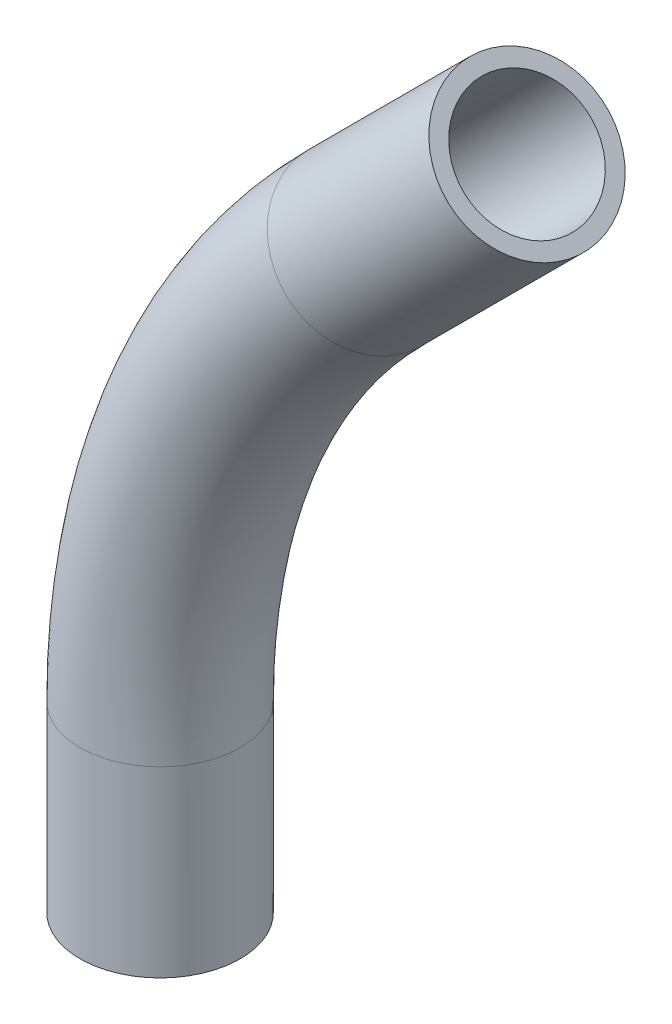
from build123d import *

# Parameters (mm, degrees)
ROUTE_R                       = 16.7005
ELBOWSHELL_T                  = -3.3782
SKETCH2_R                     = 16.7005
SKETCH2_R_2                   = 13.3223
ELBOWEXTENSION_EXTRUDE1_DEPTH = 47.625
SKETCH3_R                     = 16.7005
SKETCH3_R_2                   = 13.3223
ELBOWEXTENSION_EXTRUDE2_DEPTH = 38.1


with BuildPart() as part:
    # Elbow: sweep along a path in ElbowArc
    with BuildLine(Plane.XY) as elbow_path:
        ThreePointArc((-146.05, 0), (-134.932605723, 55.890915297), (-103.272945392, 103.272945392))
    # Route → Elbow (sweep)
    with BuildSketch(Plane(origin=(0, 0, 0), x_dir=(1, 0, 0), z_dir=(0, 1, 0))):
        with Locations((-146.05, 0)):
            Circle(ROUTE_R)
    sweep(path=elbow_path.line)

    # ElbowShell
    elbowshell_openings = [part.faces().sort_by_distance(p)[0] for p in [
        (-103.272945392, 103.272945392, 0),
        (-146.05, 0, 0),
    ]]
    offset(amount=ELBOWSHELL_T, openings=elbowshell_openings, kind=Kind.INTERSECTION)

    # Sketch2 → ElbowExtension-Extrude1 (add)
    with BuildSketch(Plane(origin=(0, 0, 0), x_dir=(0, 0, -1), z_dir=(0.7071067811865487, 0.7071067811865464, 0))):
        with Locations(Location((0, 146.05, 0), (0, 0, 90))):
            Circle(SKETCH2_R)
        with Locations(Location((0, 146.05, 0), (0, 0, 90))):
            Circle(SKETCH2_R_2, mode=Mode.SUBTRACT)
    extrude(amount=ELBOWEXTENSION_EXTRUDE1_DEPTH)

    # Sketch3 → ElbowExtension-Extrude2 (add)
    with BuildSketch(Plane.XZ):
        with Locations(Location((-146.05, 0, 0), (0, 0, 180))):
            Circle(SKETCH3_R)
        with Locations(Location((-146.05, 0, 0), (0, 0, 180))):
            Circle(SKETCH3_R_2, mode=Mode.SUBTRACT)
    extrude(amount=ELBOWEXTENSION_EXTRUDE2_DEPTH)


solid = part.part
